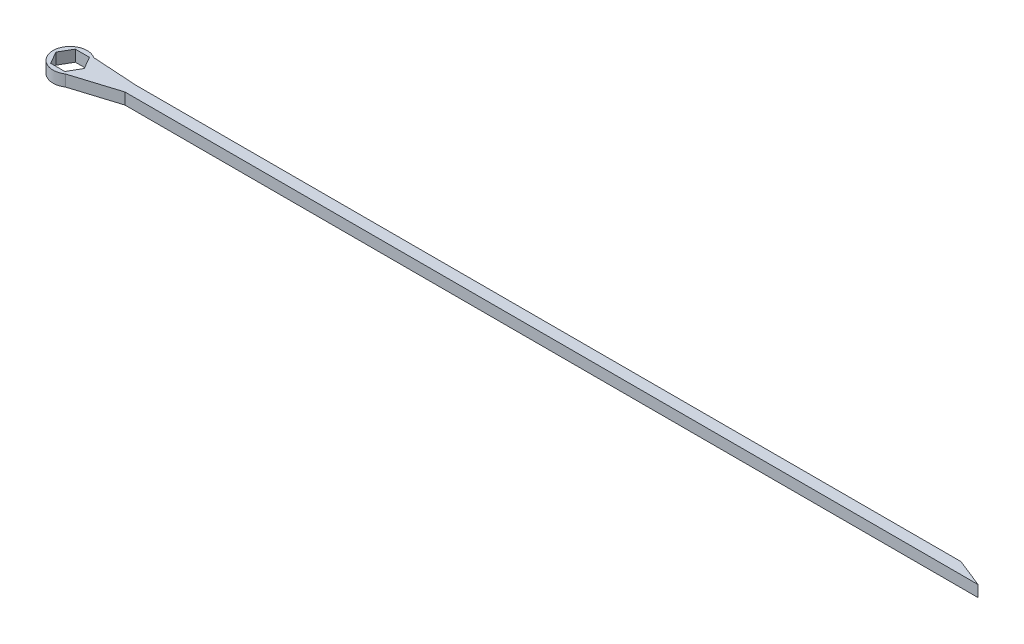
from build123d import *

# Parameters (mm, degrees)
BOSS_EXTRUDE1_DEPTH = 1


with BuildPart() as part:
    # Sketch1 → Boss-Extrude1 (new body)
    with BuildSketch(Plane(origin=(0, 0, 0), x_dir=(1, 0, 0), z_dir=(0, 1, 0))):
        with BuildLine():
            Line((4.829156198, 0), (80, 0))
            Line((80, 0), (77.5, 1))
            Line((77.5, 1), (4.829156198, 1))
            Line((4.829156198, 1), (0.829156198, 1.25))
            ThreePointArc((0.829156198, 1.25), (-1.5, 0), (0.829156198, -1.25))
            Line((0.829156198, -1.25), (4.829156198, 0))
        make_face()
        Polygon((1.25, 0), (0.625, 1.082531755), (-0.625, 1.082531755), (-1.25, 0), (-0.625, -1.082531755), (0.625, -1.082531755), align=None, mode=Mode.SUBTRACT)
    extrude(amount=BOSS_EXTRUDE1_DEPTH)


solid = part.part
